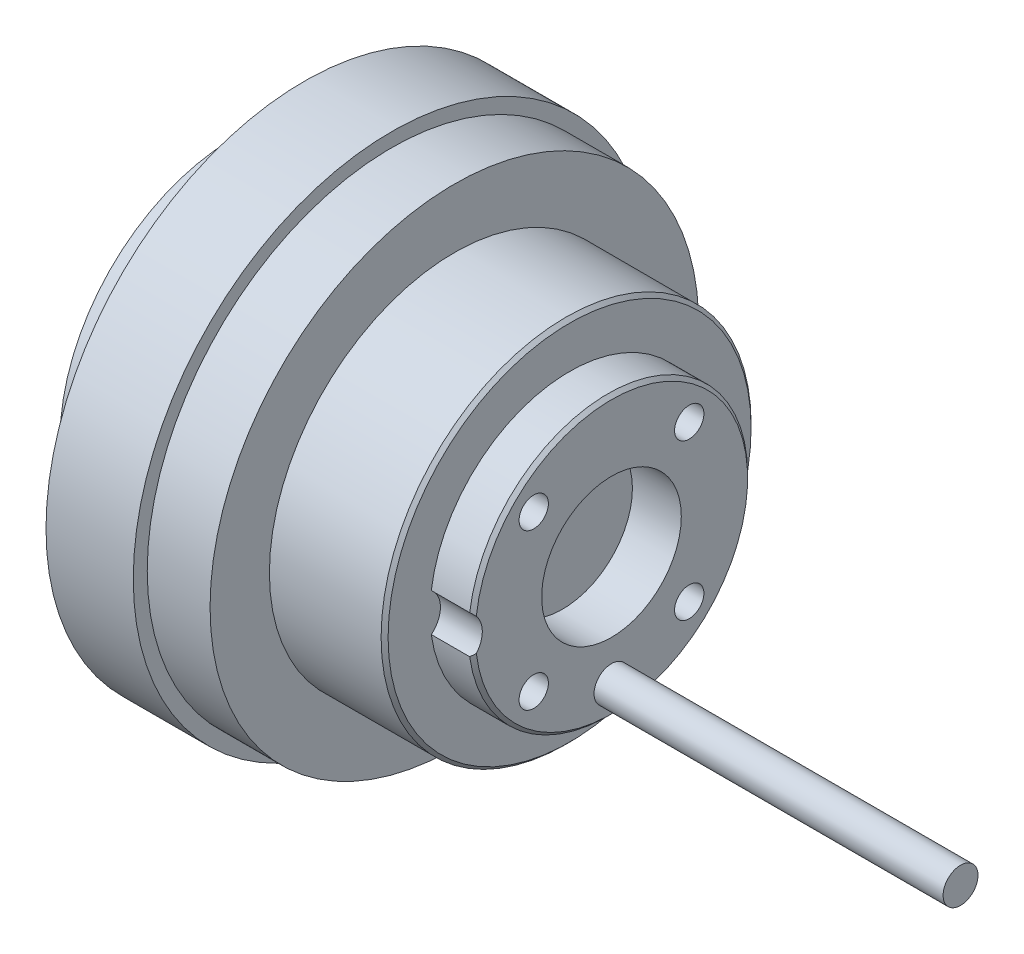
ISO-10303-21;
HEADER;
FILE_DESCRIPTION(('STEP AP214'),'2;1');
FILE_NAME('part.step','',(''),(''),'','','');
FILE_SCHEMA(('AUTOMOTIVE_DESIGN { 1 0 10303 214 1 1 1 1 }'));
ENDSEC;
DATA;
#1=APPLICATION_CONTEXT('core data for automotive mechanical design processes');
#2=APPLICATION_PROTOCOL_DEFINITION('international standard','automotive_design',2000,#1);
#3=PRODUCT_CONTEXT('',#1,'mechanical');
#4=PRODUCT('Part','Part','',(#3));
#5=PRODUCT_RELATED_PRODUCT_CATEGORY('part','',(#4));
#6=PRODUCT_DEFINITION_FORMATION('','',#4);
#7=PRODUCT_DEFINITION_CONTEXT('part definition',#1,'design');
#8=PRODUCT_DEFINITION('design','',#6,#7);
#9=PRODUCT_DEFINITION_SHAPE('','',#8);
#10=(LENGTH_UNIT() NAMED_UNIT(*) SI_UNIT(.MILLI.,.METRE.));
#11=(NAMED_UNIT(*) PLANE_ANGLE_UNIT() SI_UNIT($,.RADIAN.));
#12=(NAMED_UNIT(*) SI_UNIT($,.STERADIAN.) SOLID_ANGLE_UNIT());
#13=UNCERTAINTY_MEASURE_WITH_UNIT(LENGTH_MEASURE(1.E-05),#10,'distance_accuracy_value','');
#14=(GEOMETRIC_REPRESENTATION_CONTEXT(3) GLOBAL_UNCERTAINTY_ASSIGNED_CONTEXT((#13)) GLOBAL_UNIT_ASSIGNED_CONTEXT((#10,
#11,#12)) REPRESENTATION_CONTEXT('',''));
#15=CARTESIAN_POINT('',(0.,0.,0.));
#16=DIRECTION('',(0.,0.,1.));
#17=DIRECTION('',(1.,0.,0.));
#18=AXIS2_PLACEMENT_3D('',#15,#16,#17);
#19=CARTESIAN_POINT('',(46.,-62.2115032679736,-42.4154248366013));
#20=DIRECTION('',(-1.,0.,0.));
#21=DIRECTION('',(0.,0.,1.));
#22=AXIS2_PLACEMENT_3D('',#19,#20,#21);
#23=PLANE('',#22);
#24=CARTESIAN_POINT('',(46.,0.,0.));
#25=DIRECTION('',(-1.,0.,0.));
#26=DIRECTION('',(0.,0.,1.));
#27=AXIS2_PLACEMENT_3D('',#24,#25,#26);
#28=CIRCLE('',#27,37.);
#29=CARTESIAN_POINT('',(46.,0.,37.));
#30=VERTEX_POINT('',#29);
#31=EDGE_CURVE('E234',#30,#30,#28,.T.);
#32=ORIENTED_EDGE('',*,*,#31,.T.);
#33=EDGE_LOOP('',(#32));
#34=FACE_BOUND('',#33,.T.);
#35=CARTESIAN_POINT('',(46.,0.,0.));
#36=DIRECTION('',(-1.,0.,0.));
#37=DIRECTION('',(0.,0.,1.));
#38=AXIS2_PLACEMENT_3D('',#35,#36,#37);
#39=CIRCLE('',#38,25.);
#40=CARTESIAN_POINT('',(46.,0.,25.));
#41=VERTEX_POINT('',#40);
#42=EDGE_CURVE('E257',#41,#41,#39,.T.);
#43=ORIENTED_EDGE('',*,*,#42,.F.);
#44=EDGE_LOOP('',(#43));
#45=FACE_BOUND('',#44,.T.);
#46=ADVANCED_FACE('F39',(#34,#45),#23,.T.);
#47=CARTESIAN_POINT('',(90.,0.,0.));
#48=DIRECTION('',(1.,0.,0.));
#49=DIRECTION('',(0.,0.,-1.));
#50=AXIS2_PLACEMENT_3D('',#47,#48,#49);
#51=PLANE('',#50);
#52=CARTESIAN_POINT('',(90.,0.,22.));
#53=DIRECTION('',(1.,0.,0.));
#54=DIRECTION('',(0.,0.,-1.));
#55=AXIS2_PLACEMENT_3D('',#52,#53,#54);
#56=CIRCLE('',#55,3.50000000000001);
#57=CARTESIAN_POINT('',(90.,-2.30208313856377,19.3636363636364));
#58=VERTEX_POINT('',#57);
#59=CARTESIAN_POINT('',(90.,2.30208313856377,19.3636363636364));
#60=VERTEX_POINT('',#59);
#61=EDGE_CURVE('E205',#58,#60,#56,.T.);
#62=ORIENTED_EDGE('',*,*,#61,.F.);
#63=CARTESIAN_POINT('',(90.,0.,0.));
#64=DIRECTION('',(1.,0.,0.));
#65=DIRECTION('',(0.,0.,-1.));
#66=AXIS2_PLACEMENT_3D('',#63,#64,#65);
#67=CIRCLE('',#66,19.5);
#68=EDGE_CURVE('E105',#58,#60,#67,.T.);
#69=ORIENTED_EDGE('',*,*,#68,.T.);
#70=EDGE_LOOP('',(#62,#69));
#71=FACE_BOUND('',#70,.T.);
#72=CARTESIAN_POINT('',(90.,11.1369318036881,11.1369318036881));
#73=DIRECTION('',(1.,0.,0.));
#74=DIRECTION('',(0.,0.,-1.));
#75=AXIS2_PLACEMENT_3D('',#72,#73,#74);
#76=CIRCLE('',#75,2.1);
#77=CARTESIAN_POINT('',(90.,11.1369318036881,9.03693180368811));
#78=VERTEX_POINT('',#77);
#79=EDGE_CURVE('E210',#78,#78,#76,.T.);
#80=ORIENTED_EDGE('',*,*,#79,.F.);
#81=EDGE_LOOP('',(#80));
#82=FACE_BOUND('',#81,.T.);
#83=CARTESIAN_POINT('',(90.,-11.1369318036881,11.1369318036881));
#84=DIRECTION('',(1.,0.,0.));
#85=DIRECTION('',(0.,0.,-1.));
#86=AXIS2_PLACEMENT_3D('',#83,#84,#85);
#87=CIRCLE('',#86,2.1);
#88=CARTESIAN_POINT('',(90.,-11.1369318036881,9.0369318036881));
#89=VERTEX_POINT('',#88);
#90=EDGE_CURVE('E214',#89,#89,#87,.T.);
#91=ORIENTED_EDGE('',*,*,#90,.F.);
#92=EDGE_LOOP('',(#91));
#93=FACE_BOUND('',#92,.T.);
#94=CARTESIAN_POINT('',(90.,-11.1369318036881,-11.1369318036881));
#95=DIRECTION('',(1.,0.,0.));
#96=DIRECTION('',(0.,0.,-1.));
#97=AXIS2_PLACEMENT_3D('',#94,#95,#96);
#98=CIRCLE('',#97,2.1);
#99=CARTESIAN_POINT('',(90.,-11.1369318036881,-13.2369318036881));
#100=VERTEX_POINT('',#99);
#101=EDGE_CURVE('E218',#100,#100,#98,.T.);
#102=ORIENTED_EDGE('',*,*,#101,.F.);
#103=EDGE_LOOP('',(#102));
#104=FACE_BOUND('',#103,.T.);
#105=CARTESIAN_POINT('',(90.,11.1369318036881,-11.1369318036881));
#106=DIRECTION('',(1.,0.,0.));
#107=DIRECTION('',(0.,0.,-1.));
#108=AXIS2_PLACEMENT_3D('',#105,#106,#107);
#109=CIRCLE('',#108,2.1);
#110=CARTESIAN_POINT('',(90.,11.1369318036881,-13.2369318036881));
#111=VERTEX_POINT('',#110);
#112=EDGE_CURVE('E222',#111,#111,#109,.T.);
#113=ORIENTED_EDGE('',*,*,#112,.F.);
#114=EDGE_LOOP('',(#113));
#115=FACE_BOUND('',#114,.T.);
#116=CARTESIAN_POINT('',(90.,-15.75,0.));
#117=DIRECTION('',(1.,0.,0.));
#118=DIRECTION('',(0.,0.,-1.));
#119=AXIS2_PLACEMENT_3D('',#116,#117,#118);
#120=CIRCLE('',#119,2.5);
#121=CARTESIAN_POINT('',(90.,-15.75,-2.5));
#122=VERTEX_POINT('',#121);
#123=EDGE_CURVE('E226',#122,#122,#120,.T.);
#124=ORIENTED_EDGE('',*,*,#123,.F.);
#125=EDGE_LOOP('',(#124));
#126=FACE_BOUND('',#125,.T.);
#127=CARTESIAN_POINT('',(90.,0.,0.));
#128=DIRECTION('',(1.,0.,0.));
#129=DIRECTION('',(0.,0.,-1.));
#130=AXIS2_PLACEMENT_3D('',#127,#128,#129);
#131=CIRCLE('',#130,10.);
#132=CARTESIAN_POINT('',(90.,0.,-10.));
#133=VERTEX_POINT('',#132);
#134=EDGE_CURVE('E229',#133,#133,#131,.T.);
#135=ORIENTED_EDGE('',*,*,#134,.F.);
#136=EDGE_LOOP('',(#135));
#137=FACE_BOUND('',#136,.T.);
#138=ADVANCED_FACE('F196',(#71,#82,#93,#104,#115,#126,#137),#51,.T.);
#139=CARTESIAN_POINT('',(0.,0.,0.));
#140=DIRECTION('',(-1.,0.,0.));
#141=DIRECTION('',(0.,0.,1.));
#142=AXIS2_PLACEMENT_3D('',#139,#140,#141);
#143=CYLINDRICAL_SURFACE('',#142,20.);
#144=DIRECTION('',(1.,0.,0.));
#145=VECTOR('',#144,1.);
#146=CARTESIAN_POINT('',(78.3334865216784,2.73218662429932,19.8125));
#147=LINE('',#146,#145);
#148=CARTESIAN_POINT('',(84.,2.73218662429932,19.8125));
#149=VERTEX_POINT('',#148);
#150=CARTESIAN_POINT('',(89.5,2.73218662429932,19.8125));
#151=VERTEX_POINT('',#150);
#152=EDGE_CURVE('E85',#149,#151,#147,.T.);
#153=ORIENTED_EDGE('',*,*,#152,.T.);
#154=CARTESIAN_POINT('',(89.5,0.,0.));
#155=DIRECTION('',(1.,0.,0.));
#156=DIRECTION('',(0.,0.,-1.));
#157=AXIS2_PLACEMENT_3D('',#154,#155,#156);
#158=CIRCLE('',#157,20.);
#159=CARTESIAN_POINT('',(89.5,-2.73218662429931,19.8125));
#160=VERTEX_POINT('',#159);
#161=EDGE_CURVE('E102',#151,#160,#158,.F.);
#162=ORIENTED_EDGE('',*,*,#161,.T.);
#163=DIRECTION('',(1.,0.,0.));
#164=VECTOR('',#163,1.);
#165=CARTESIAN_POINT('',(78.3334865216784,-2.73218662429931,19.8125));
#166=LINE('',#165,#164);
#167=CARTESIAN_POINT('',(84.,-2.73218662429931,19.8125));
#168=VERTEX_POINT('',#167);
#169=EDGE_CURVE('E59',#168,#160,#166,.T.);
#170=ORIENTED_EDGE('',*,*,#169,.F.);
#171=CARTESIAN_POINT('',(84.,0.,0.));
#172=DIRECTION('',(-1.,0.,0.));
#173=DIRECTION('',(0.,0.,1.));
#174=AXIS2_PLACEMENT_3D('',#171,#172,#173);
#175=CIRCLE('',#174,20.);
#176=EDGE_CURVE('E98',#149,#168,#175,.T.);
#177=ORIENTED_EDGE('',*,*,#176,.F.);
#178=EDGE_LOOP('',(#153,#162,#170,#177));
#179=FACE_BOUND('',#178,.T.);
#180=ADVANCED_FACE('F101',(#179),#143,.T.);
#181=CARTESIAN_POINT('',(84.,0.,20.));
#182=DIRECTION('',(1.,0.,0.));
#183=DIRECTION('',(0.,0.,-1.));
#184=AXIS2_PLACEMENT_3D('',#181,#182,#183);
#185=PLANE('',#184);
#186=CARTESIAN_POINT('',(84.,0.,0.));
#187=DIRECTION('',(1.,0.,0.));
#188=DIRECTION('',(0.,0.,-1.));
#189=AXIS2_PLACEMENT_3D('',#186,#187,#188);
#190=CIRCLE('',#189,26.);
#191=CARTESIAN_POINT('',(84.,0.,-26.));
#192=VERTEX_POINT('',#191);
#193=EDGE_CURVE('E117',#192,#192,#190,.T.);
#194=ORIENTED_EDGE('',*,*,#193,.T.);
#195=EDGE_LOOP('',(#194));
#196=FACE_BOUND('',#195,.T.);
#197=ORIENTED_EDGE('',*,*,#176,.T.);
#198=CARTESIAN_POINT('',(84.,0.,22.));
#199=DIRECTION('',(1.,0.,0.));
#200=DIRECTION('',(0.,0.,-1.));
#201=AXIS2_PLACEMENT_3D('',#198,#199,#200);
#202=CIRCLE('',#201,3.50000000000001);
#203=EDGE_CURVE('E88',#149,#168,#202,.F.);
#204=ORIENTED_EDGE('',*,*,#203,.F.);
#205=EDGE_LOOP('',(#197,#204));
#206=FACE_BOUND('',#205,.T.);
#207=ADVANCED_FACE('F97',(#196,#206),#185,.T.);
#208=CARTESIAN_POINT('',(0.,0.,0.));
#209=DIRECTION('',(-1.,0.,0.));
#210=DIRECTION('',(0.,0.,1.));
#211=AXIS2_PLACEMENT_3D('',#208,#209,#210);
#212=CYLINDRICAL_SURFACE('',#211,26.5);
#213=CARTESIAN_POINT('',(83.5,0.,0.));
#214=DIRECTION('',(1.,0.,0.));
#215=DIRECTION('',(0.,0.,-1.));
#216=AXIS2_PLACEMENT_3D('',#213,#214,#215);
#217=CIRCLE('',#216,26.5);
#218=CARTESIAN_POINT('',(83.5,0.,-26.5));
#219=VERTEX_POINT('',#218);
#220=EDGE_CURVE('E114',#219,#219,#217,.F.);
#221=ORIENTED_EDGE('',*,*,#220,.T.);
#222=EDGE_LOOP('',(#221));
#223=FACE_BOUND('',#222,.T.);
#224=CARTESIAN_POINT('',(67.5,0.,0.));
#225=DIRECTION('',(-1.,0.,0.));
#226=DIRECTION('',(0.,0.,1.));
#227=AXIS2_PLACEMENT_3D('',#224,#225,#226);
#228=CIRCLE('',#227,26.5);
#229=CARTESIAN_POINT('',(67.5,0.,26.5));
#230=VERTEX_POINT('',#229);
#231=EDGE_CURVE('E103',#230,#230,#228,.T.);
#232=ORIENTED_EDGE('',*,*,#231,.F.);
#233=EDGE_LOOP('',(#232));
#234=FACE_BOUND('',#233,.T.);
#235=ADVANCED_FACE('F187',(#223,#234),#212,.T.);
#236=CARTESIAN_POINT('',(67.5,0.,26.5));
#237=DIRECTION('',(1.,0.,0.));
#238=DIRECTION('',(0.,0.,-1.));
#239=AXIS2_PLACEMENT_3D('',#236,#237,#238);
#240=PLANE('',#239);
#241=ORIENTED_EDGE('',*,*,#231,.T.);
#242=EDGE_LOOP('',(#241));
#243=FACE_BOUND('',#242,.T.);
#244=CARTESIAN_POINT('',(67.5,0.,0.));
#245=DIRECTION('',(-1.,0.,0.));
#246=DIRECTION('',(0.,0.,1.));
#247=AXIS2_PLACEMENT_3D('',#244,#245,#246);
#248=CIRCLE('',#247,35.);
#249=CARTESIAN_POINT('',(67.5,0.,35.));
#250=VERTEX_POINT('',#249);
#251=EDGE_CURVE('E108',#250,#250,#248,.T.);
#252=ORIENTED_EDGE('',*,*,#251,.F.);
#253=EDGE_LOOP('',(#252));
#254=FACE_BOUND('',#253,.T.);
#255=ADVANCED_FACE('F183',(#243,#254),#240,.T.);
#256=CARTESIAN_POINT('',(0.,0.,0.));
#257=DIRECTION('',(-1.,0.,0.));
#258=DIRECTION('',(0.,0.,1.));
#259=AXIS2_PLACEMENT_3D('',#256,#257,#258);
#260=CYLINDRICAL_SURFACE('',#259,35.);
#261=ORIENTED_EDGE('',*,*,#251,.T.);
#262=EDGE_LOOP('',(#261));
#263=FACE_BOUND('',#262,.T.);
#264=CARTESIAN_POINT('',(58.5,0.,0.));
#265=DIRECTION('',(-1.,0.,0.));
#266=DIRECTION('',(0.,0.,1.));
#267=AXIS2_PLACEMENT_3D('',#264,#265,#266);
#268=CIRCLE('',#267,35.);
#269=CARTESIAN_POINT('',(58.5,0.,35.));
#270=VERTEX_POINT('',#269);
#271=EDGE_CURVE('E243',#270,#270,#268,.T.);
#272=ORIENTED_EDGE('',*,*,#271,.F.);
#273=EDGE_LOOP('',(#272));
#274=FACE_BOUND('',#273,.T.);
#275=ADVANCED_FACE('F179',(#263,#274),#260,.T.);
#276=CARTESIAN_POINT('',(58.5,0.,35.));
#277=DIRECTION('',(1.,0.,0.));
#278=DIRECTION('',(0.,0.,-1.));
#279=AXIS2_PLACEMENT_3D('',#276,#277,#278);
#280=PLANE('',#279);
#281=ORIENTED_EDGE('',*,*,#271,.T.);
#282=EDGE_LOOP('',(#281));
#283=FACE_BOUND('',#282,.T.);
#284=CARTESIAN_POINT('',(58.5,0.,0.));
#285=DIRECTION('',(-1.,0.,0.));
#286=DIRECTION('',(0.,0.,1.));
#287=AXIS2_PLACEMENT_3D('',#284,#285,#286);
#288=CIRCLE('',#287,37.);
#289=CARTESIAN_POINT('',(58.5,0.,37.));
#290=VERTEX_POINT('',#289);
#291=EDGE_CURVE('E240',#290,#290,#288,.T.);
#292=ORIENTED_EDGE('',*,*,#291,.F.);
#293=EDGE_LOOP('',(#292));
#294=FACE_BOUND('',#293,.T.);
#295=ADVANCED_FACE('F175',(#283,#294),#280,.T.);
#296=CARTESIAN_POINT('',(0.,0.,0.));
#297=DIRECTION('',(-1.,0.,0.));
#298=DIRECTION('',(0.,0.,1.));
#299=AXIS2_PLACEMENT_3D('',#296,#297,#298);
#300=CYLINDRICAL_SURFACE('',#299,37.);
#301=ORIENTED_EDGE('',*,*,#291,.T.);
#302=EDGE_LOOP('',(#301));
#303=FACE_BOUND('',#302,.T.);
#304=ORIENTED_EDGE('',*,*,#31,.F.);
#305=EDGE_LOOP('',(#304));
#306=FACE_BOUND('',#305,.T.);
#307=ADVANCED_FACE('F172',(#303,#306),#300,.T.);
#308=CARTESIAN_POINT('',(89.5,0.,0.));
#309=DIRECTION('',(-1.,0.,0.));
#310=DIRECTION('',(0.,0.,1.));
#311=AXIS2_PLACEMENT_3D('',#308,#309,#310);
#312=CONICAL_SURFACE('',#311,20.,0.785398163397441);
#313=CARTESIAN_POINT('',(90.0002,2.30188010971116,19.3634590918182));
#314=CARTESIAN_POINT('',(89.9604779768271,2.3422035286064,19.3986664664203));
#315=CARTESIAN_POINT('',(89.9201671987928,2.38138684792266,19.4345040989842));
#316=CARTESIAN_POINT('',(89.8385615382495,2.45746574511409,19.5072842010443));
#317=CARTESIAN_POINT('',(89.797268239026,2.49436469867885,19.5442249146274));
#318=CARTESIAN_POINT('',(89.7137713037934,2.56598788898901,19.6191614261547));
#319=CARTESIAN_POINT('',(89.671567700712,2.60071220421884,19.6571571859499));
#320=CARTESIAN_POINT('',(89.5862928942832,2.668085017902,19.7341796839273));
#321=CARTESIAN_POINT('',(89.5432204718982,2.70073028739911,19.7732078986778));
#322=CARTESIAN_POINT('',(89.4998,2.73233218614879,19.8126818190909));
#323=B_SPLINE_CURVE_WITH_KNOTS('',3,(#313,#314,#315,#316,#317,#318,#319,#320,#321,#322),
.UNSPECIFIED.,.F.,.F.,(4,2,2,2,4),(0.,0.19995207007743,0.399601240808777,0.59924320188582,
0.799188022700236),.UNSPECIFIED.);
#324=EDGE_CURVE('E12',#60,#151,#323,.T.);
#325=ORIENTED_EDGE('',*,*,#324,.F.);
#326=ORIENTED_EDGE('',*,*,#68,.F.);
#327=CARTESIAN_POINT('',(89.4998,-2.73233218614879,19.8126818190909));
#328=CARTESIAN_POINT('',(89.5432204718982,-2.70073028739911,19.7732078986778));
#329=CARTESIAN_POINT('',(89.5862928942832,-2.668085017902,19.7341796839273));
#330=CARTESIAN_POINT('',(89.671567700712,-2.60071220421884,19.6571571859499));
#331=CARTESIAN_POINT('',(89.7137713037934,-2.56598788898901,19.6191614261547));
#332=CARTESIAN_POINT('',(89.797268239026,-2.49436469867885,19.5442249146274));
#333=CARTESIAN_POINT('',(89.8385615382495,-2.45746574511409,19.5072842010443));
#334=CARTESIAN_POINT('',(89.9201671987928,-2.38138684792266,19.4345040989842));
#335=CARTESIAN_POINT('',(89.9604779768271,-2.3422035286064,19.3986664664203));
#336=CARTESIAN_POINT('',(90.0002,-2.30188010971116,19.3634590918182));
#337=B_SPLINE_CURVE_WITH_KNOTS('',3,(#327,#328,#329,#330,#331,#332,#333,#334,#335,#336),
.UNSPECIFIED.,.F.,.F.,(4,2,2,2,4),(0.,0.199944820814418,0.399586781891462,0.599235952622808,
0.799188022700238),.UNSPECIFIED.);
#338=EDGE_CURVE('E52',#160,#58,#337,.T.);
#339=ORIENTED_EDGE('',*,*,#338,.F.);
#340=ORIENTED_EDGE('',*,*,#161,.F.);
#341=EDGE_LOOP('',(#325,#326,#339,#340));
#342=FACE_BOUND('',#341,.T.);
#343=ADVANCED_FACE('F123',(#342),#312,.T.);
#344=CARTESIAN_POINT('',(83.5,0.,0.));
#345=DIRECTION('',(-1.,0.,0.));
#346=DIRECTION('',(0.,0.,1.));
#347=AXIS2_PLACEMENT_3D('',#344,#345,#346);
#348=CONICAL_SURFACE('',#347,26.5,0.785398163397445);
#349=ORIENTED_EDGE('',*,*,#193,.F.);
#350=EDGE_LOOP('',(#349));
#351=FACE_BOUND('',#350,.T.);
#352=ORIENTED_EDGE('',*,*,#220,.F.);
#353=EDGE_LOOP('',(#352));
#354=FACE_BOUND('',#353,.T.);
#355=ADVANCED_FACE('F41',(#351,#354),#348,.T.);
#356=CARTESIAN_POINT('',(83.,0.,0.));
#357=DIRECTION('',(1.,0.,0.));
#358=DIRECTION('',(0.,0.,-1.));
#359=AXIS2_PLACEMENT_3D('',#356,#357,#358);
#360=CYLINDRICAL_SURFACE('',#359,10.);
#361=CARTESIAN_POINT('',(83.,0.,0.));
#362=DIRECTION('',(1.,0.,0.));
#363=DIRECTION('',(0.,0.,-1.));
#364=AXIS2_PLACEMENT_3D('',#361,#362,#363);
#365=CIRCLE('',#364,10.);
#366=CARTESIAN_POINT('',(83.,0.,-10.));
#367=VERTEX_POINT('',#366);
#368=EDGE_CURVE('E231',#367,#367,#365,.T.);
#369=ORIENTED_EDGE('',*,*,#368,.F.);
#370=EDGE_LOOP('',(#369));
#371=FACE_BOUND('',#370,.T.);
#372=ORIENTED_EDGE('',*,*,#134,.T.);
#373=EDGE_LOOP('',(#372));
#374=FACE_BOUND('',#373,.T.);
#375=ADVANCED_FACE('F167',(#371,#374),#360,.F.);
#376=CARTESIAN_POINT('',(83.,0.,0.));
#377=DIRECTION('',(1.,0.,0.));
#378=DIRECTION('',(0.,0.,-1.));
#379=AXIS2_PLACEMENT_3D('',#376,#377,#378);
#380=PLANE('',#379);
#381=ORIENTED_EDGE('',*,*,#368,.T.);
#382=EDGE_LOOP('',(#381));
#383=FACE_BOUND('',#382,.T.);
#384=ADVANCED_FACE('F163',(#383),#380,.T.);
#385=CARTESIAN_POINT('',(90.,11.1369318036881,-11.1369318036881));
#386=DIRECTION('',(1.,0.,0.));
#387=DIRECTION('',(0.,0.,-1.));
#388=AXIS2_PLACEMENT_3D('',#385,#386,#387);
#389=CYLINDRICAL_SURFACE('',#388,2.1);
#390=CARTESIAN_POINT('',(78.6,11.1369318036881,-11.1369318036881));
#391=DIRECTION('',(1.,0.,0.));
#392=DIRECTION('',(0.,0.,-1.));
#393=AXIS2_PLACEMENT_3D('',#390,#391,#392);
#394=CIRCLE('',#393,2.1);
#395=CARTESIAN_POINT('',(78.6,11.1369318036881,-13.2369318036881));
#396=VERTEX_POINT('',#395);
#397=EDGE_CURVE('E280',#396,#396,#394,.T.);
#398=ORIENTED_EDGE('',*,*,#397,.F.);
#399=EDGE_LOOP('',(#398));
#400=FACE_BOUND('',#399,.T.);
#401=ORIENTED_EDGE('',*,*,#112,.T.);
#402=EDGE_LOOP('',(#401));
#403=FACE_BOUND('',#402,.T.);
#404=ADVANCED_FACE('F160',(#400,#403),#389,.F.);
#405=CARTESIAN_POINT('',(78.6,11.1369318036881,-11.1369318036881));
#406=DIRECTION('',(1.,0.,0.));
#407=DIRECTION('',(0.,0.,-1.));
#408=AXIS2_PLACEMENT_3D('',#405,#406,#407);
#409=CONICAL_SURFACE('',#408,2.1,1.02974425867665);
#410=CARTESIAN_POINT('',(77.3381927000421,11.1369318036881,-11.1369318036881));
#411=VERTEX_POINT('',#410);
#412=VERTEX_LOOP('',#411);
#413=FACE_BOUND('',#412,.T.);
#414=ORIENTED_EDGE('',*,*,#397,.T.);
#415=EDGE_LOOP('',(#414));
#416=FACE_BOUND('',#415,.T.);
#417=ADVANCED_FACE('F156',(#413,#416),#409,.F.);
#418=CARTESIAN_POINT('',(90.,-11.1369318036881,-11.1369318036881));
#419=DIRECTION('',(1.,0.,0.));
#420=DIRECTION('',(0.,0.,-1.));
#421=AXIS2_PLACEMENT_3D('',#418,#419,#420);
#422=CYLINDRICAL_SURFACE('',#421,2.1);
#423=CARTESIAN_POINT('',(78.6,-11.1369318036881,-11.1369318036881));
#424=DIRECTION('',(1.,0.,0.));
#425=DIRECTION('',(0.,0.,-1.));
#426=AXIS2_PLACEMENT_3D('',#423,#424,#425);
#427=CIRCLE('',#426,2.1);
#428=CARTESIAN_POINT('',(78.6,-11.1369318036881,-13.2369318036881));
#429=VERTEX_POINT('',#428);
#430=EDGE_CURVE('E276',#429,#429,#427,.T.);
#431=ORIENTED_EDGE('',*,*,#430,.F.);
#432=EDGE_LOOP('',(#431));
#433=FACE_BOUND('',#432,.T.);
#434=ORIENTED_EDGE('',*,*,#101,.T.);
#435=EDGE_LOOP('',(#434));
#436=FACE_BOUND('',#435,.T.);
#437=ADVANCED_FACE('F152',(#433,#436),#422,.F.);
#438=CARTESIAN_POINT('',(78.6,-11.1369318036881,-11.1369318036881));
#439=DIRECTION('',(1.,0.,0.));
#440=DIRECTION('',(0.,0.,-1.));
#441=AXIS2_PLACEMENT_3D('',#438,#439,#440);
#442=CONICAL_SURFACE('',#441,2.1,1.02974425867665);
#443=CARTESIAN_POINT('',(77.3381927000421,-11.1369318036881,-11.1369318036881));
#444=VERTEX_POINT('',#443);
#445=VERTEX_LOOP('',#444);
#446=FACE_BOUND('',#445,.T.);
#447=ORIENTED_EDGE('',*,*,#430,.T.);
#448=EDGE_LOOP('',(#447));
#449=FACE_BOUND('',#448,.T.);
#450=ADVANCED_FACE('F148',(#446,#449),#442,.F.);
#451=CARTESIAN_POINT('',(90.,-11.1369318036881,11.1369318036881));
#452=DIRECTION('',(1.,0.,0.));
#453=DIRECTION('',(0.,0.,-1.));
#454=AXIS2_PLACEMENT_3D('',#451,#452,#453);
#455=CYLINDRICAL_SURFACE('',#454,2.1);
#456=CARTESIAN_POINT('',(78.6,-11.1369318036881,11.1369318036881));
#457=DIRECTION('',(1.,0.,0.));
#458=DIRECTION('',(0.,0.,-1.));
#459=AXIS2_PLACEMENT_3D('',#456,#457,#458);
#460=CIRCLE('',#459,2.1);
#461=CARTESIAN_POINT('',(78.6,-11.1369318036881,9.03693180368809));
#462=VERTEX_POINT('',#461);
#463=EDGE_CURVE('E272',#462,#462,#460,.T.);
#464=ORIENTED_EDGE('',*,*,#463,.F.);
#465=EDGE_LOOP('',(#464));
#466=FACE_BOUND('',#465,.T.);
#467=ORIENTED_EDGE('',*,*,#90,.T.);
#468=EDGE_LOOP('',(#467));
#469=FACE_BOUND('',#468,.T.);
#470=ADVANCED_FACE('F144',(#466,#469),#455,.F.);
#471=CARTESIAN_POINT('',(78.6,-11.1369318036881,11.1369318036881));
#472=DIRECTION('',(1.,0.,0.));
#473=DIRECTION('',(0.,0.,-1.));
#474=AXIS2_PLACEMENT_3D('',#471,#472,#473);
#475=CONICAL_SURFACE('',#474,2.1,1.02974425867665);
#476=CARTESIAN_POINT('',(77.3381927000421,-11.1369318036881,11.1369318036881));
#477=VERTEX_POINT('',#476);
#478=VERTEX_LOOP('',#477);
#479=FACE_BOUND('',#478,.T.);
#480=ORIENTED_EDGE('',*,*,#463,.T.);
#481=EDGE_LOOP('',(#480));
#482=FACE_BOUND('',#481,.T.);
#483=ADVANCED_FACE('F140',(#479,#482),#475,.F.);
#484=CARTESIAN_POINT('',(90.,11.1369318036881,11.1369318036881));
#485=DIRECTION('',(1.,0.,0.));
#486=DIRECTION('',(0.,0.,-1.));
#487=AXIS2_PLACEMENT_3D('',#484,#485,#486);
#488=CYLINDRICAL_SURFACE('',#487,2.1);
#489=CARTESIAN_POINT('',(78.6,11.1369318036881,11.1369318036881));
#490=DIRECTION('',(1.,0.,0.));
#491=DIRECTION('',(0.,0.,-1.));
#492=AXIS2_PLACEMENT_3D('',#489,#490,#491);
#493=CIRCLE('',#492,2.1);
#494=CARTESIAN_POINT('',(78.6,11.1369318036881,9.03693180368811));
#495=VERTEX_POINT('',#494);
#496=EDGE_CURVE('E99',#495,#495,#493,.T.);
#497=ORIENTED_EDGE('',*,*,#496,.F.);
#498=EDGE_LOOP('',(#497));
#499=FACE_BOUND('',#498,.T.);
#500=ORIENTED_EDGE('',*,*,#79,.T.);
#501=EDGE_LOOP('',(#500));
#502=FACE_BOUND('',#501,.T.);
#503=ADVANCED_FACE('F136',(#499,#502),#488,.F.);
#504=CARTESIAN_POINT('',(78.6,11.1369318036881,11.1369318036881));
#505=DIRECTION('',(1.,0.,0.));
#506=DIRECTION('',(0.,0.,-1.));
#507=AXIS2_PLACEMENT_3D('',#504,#505,#506);
#508=CONICAL_SURFACE('',#507,2.1,1.02974425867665);
#509=CARTESIAN_POINT('',(77.3381927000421,11.1369318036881,11.1369318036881));
#510=VERTEX_POINT('',#509);
#511=VERTEX_LOOP('',#510);
#512=FACE_BOUND('',#511,.T.);
#513=ORIENTED_EDGE('',*,*,#496,.T.);
#514=EDGE_LOOP('',(#513));
#515=FACE_BOUND('',#514,.T.);
#516=ADVANCED_FACE('F131',(#512,#515),#508,.F.);
#517=CARTESIAN_POINT('',(78.3334865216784,0.,22.));
#518=DIRECTION('',(1.,0.,0.));
#519=DIRECTION('',(0.,0.,-1.));
#520=AXIS2_PLACEMENT_3D('',#517,#518,#519);
#521=CYLINDRICAL_SURFACE('',#520,3.50000000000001);
#522=ORIENTED_EDGE('',*,*,#324,.T.);
#523=ORIENTED_EDGE('',*,*,#152,.F.);
#524=ORIENTED_EDGE('',*,*,#203,.T.);
#525=ORIENTED_EDGE('',*,*,#169,.T.);
#526=ORIENTED_EDGE('',*,*,#338,.T.);
#527=ORIENTED_EDGE('',*,*,#61,.T.);
#528=EDGE_LOOP('',(#522,#523,#524,#525,#526,#527));
#529=FACE_BOUND('',#528,.T.);
#530=ADVANCED_FACE('F87',(#529),#521,.F.);
#531=CARTESIAN_POINT('',(140.,-15.75,0.));
#532=DIRECTION('',(-1.,0.,0.));
#533=DIRECTION('',(0.,-1.,0.));
#534=AXIS2_PLACEMENT_3D('',#531,#532,#533);
#535=CYLINDRICAL_SURFACE('',#534,2.5);
#536=ORIENTED_EDGE('',*,*,#123,.T.);
#537=EDGE_LOOP('',(#536));
#538=FACE_BOUND('',#537,.T.);
#539=CARTESIAN_POINT('',(140.,-15.75,0.));
#540=DIRECTION('',(1.,0.,0.));
#541=DIRECTION('',(0.,1.,0.));
#542=AXIS2_PLACEMENT_3D('',#539,#540,#541);
#543=CIRCLE('',#542,2.5);
#544=CARTESIAN_POINT('',(140.,-13.25,0.));
#545=VERTEX_POINT('',#544);
#546=EDGE_CURVE('E262',#545,#545,#543,.T.);
#547=ORIENTED_EDGE('',*,*,#546,.F.);
#548=EDGE_LOOP('',(#547));
#549=FACE_BOUND('',#548,.T.);
#550=ADVANCED_FACE('F130',(#538,#549),#535,.T.);
#551=CARTESIAN_POINT('',(140.,-15.75,0.));
#552=DIRECTION('',(1.,0.,0.));
#553=DIRECTION('',(0.,1.,0.));
#554=AXIS2_PLACEMENT_3D('',#551,#552,#553);
#555=PLANE('',#554);
#556=ORIENTED_EDGE('',*,*,#546,.T.);
#557=EDGE_LOOP('',(#556));
#558=FACE_BOUND('',#557,.T.);
#559=ADVANCED_FACE('F364',(#558),#555,.T.);
#560=CARTESIAN_POINT('',(36.,0.,0.));
#561=DIRECTION('',(1.,0.,0.));
#562=DIRECTION('',(0.,0.,-1.));
#563=AXIS2_PLACEMENT_3D('',#560,#561,#562);
#564=CYLINDRICAL_SURFACE('',#563,25.);
#565=CARTESIAN_POINT('',(36.,0.,0.));
#566=DIRECTION('',(-1.,0.,0.));
#567=DIRECTION('',(0.,0.,1.));
#568=AXIS2_PLACEMENT_3D('',#565,#566,#567);
#569=CIRCLE('',#568,25.);
#570=CARTESIAN_POINT('',(36.,0.,25.));
#571=VERTEX_POINT('',#570);
#572=EDGE_CURVE('E259',#571,#571,#569,.T.);
#573=ORIENTED_EDGE('',*,*,#572,.F.);
#574=EDGE_LOOP('',(#573));
#575=FACE_BOUND('',#574,.T.);
#576=ORIENTED_EDGE('',*,*,#42,.T.);
#577=EDGE_LOOP('',(#576));
#578=FACE_BOUND('',#577,.T.);
#579=ADVANCED_FACE('F371',(#575,#578),#564,.T.);
#580=CARTESIAN_POINT('',(36.,0.,0.));
#581=DIRECTION('',(-1.,0.,0.));
#582=DIRECTION('',(0.,0.,1.));
#583=AXIS2_PLACEMENT_3D('',#580,#581,#582);
#584=PLANE('',#583);
#585=ORIENTED_EDGE('',*,*,#572,.T.);
#586=EDGE_LOOP('',(#585));
#587=FACE_BOUND('',#586,.T.);
#588=ADVANCED_FACE('F380',(#587),#584,.T.);
#589=CLOSED_SHELL('',(#46,#138,#180,#207,#235,#255,#275,#295,#307,#343,#355,#375,#384,#404,#417,
#437,#450,#470,#483,#503,#516,#530,#550,#559,#579,#588));
#590=MANIFOLD_SOLID_BREP('B2',#589);
#591=ADVANCED_BREP_SHAPE_REPRESENTATION('',(#18,#590),#14);
#592=SHAPE_DEFINITION_REPRESENTATION(#9,#591);
ENDSEC;
END-ISO-10303-21;
